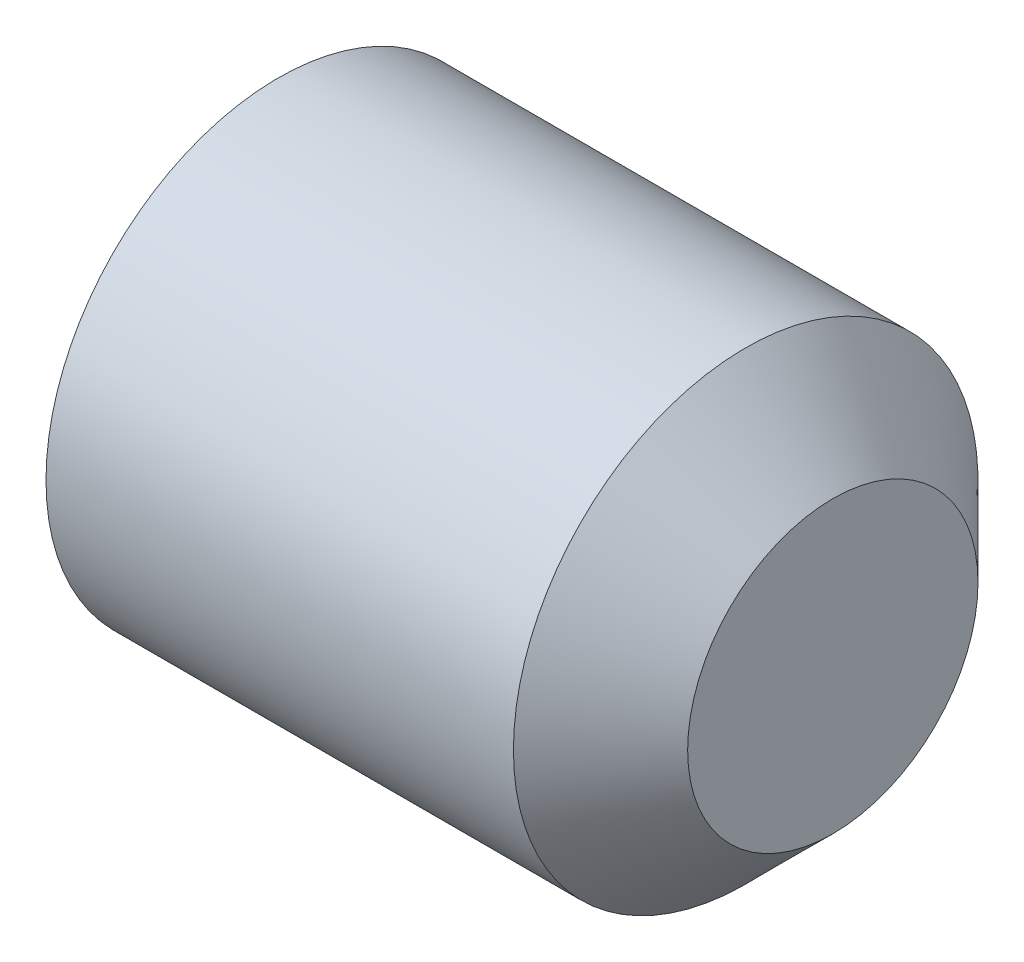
from build123d import *

# Parameters (mm, degrees)
HEX_2_DEPTH = 2.3


with BuildPart() as part:
    # BodySke → BaseBody (revolve)
    with BuildSketch(Plane.XY, mode=Mode.PRIVATE) as basebody_sk:
        Polygon((0, 0), (0, 1.61), (0.225166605, 2), (4.25, 2), (5, 1.25), (5, 0), align=None)
    revolve(basebody_sk.sketch.rotate(Axis((-12.7, 0, 0), (1, 0, 0)), 90), axis=Axis((-12.7, 0, 0), (1, 0, 0)))

    # Sketch2 → Hex 2 (cut)
    with BuildSketch(Plane.ZY):
        Polygon((0.577350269, 1), (-0.577350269, 1), (-1.154700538, 0), (-0.577350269, -1), (0.577350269, -1), (1.154700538, 0), align=None)
    extrude(amount=-HEX_2_DEPTH, mode=Mode.SUBTRACT)


solid = part.part
